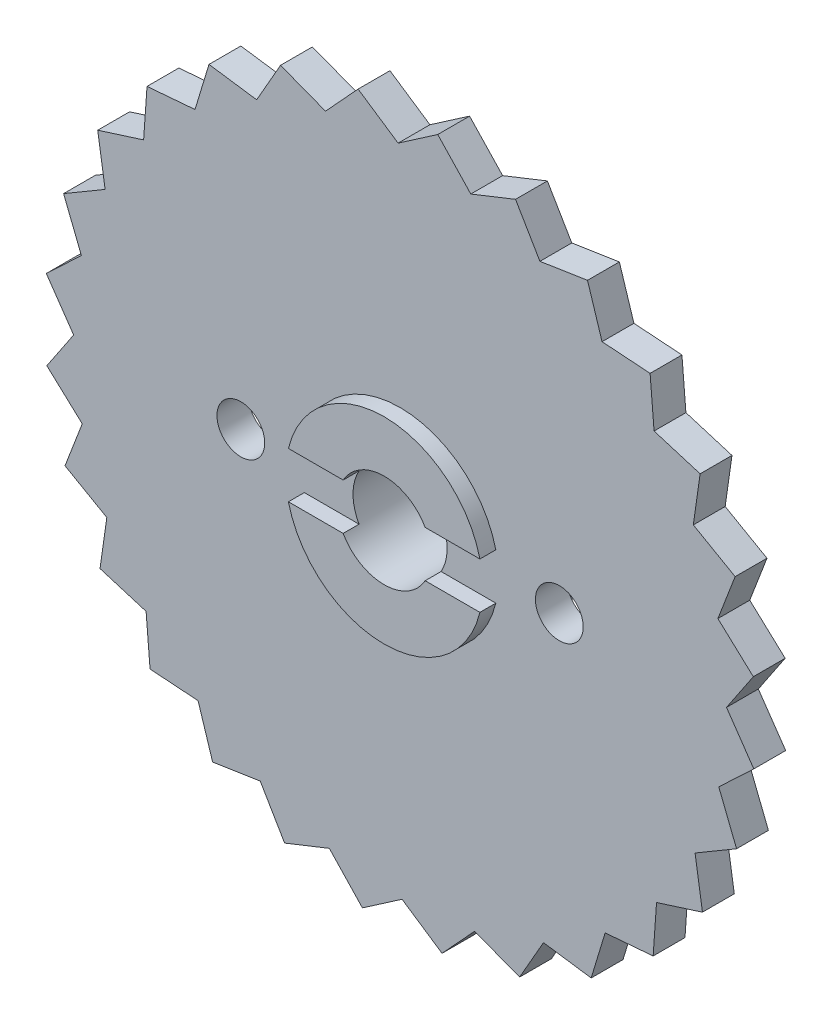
from build123d import *

# Parameters (mm, degrees)
ESQUISSE1_R                   = 22.34
EXTRUSION1_DEPTH              = 9
ENL_V_START                   = -1
ESQUISSE2_R                   = 22.34
ESQUISSE2_R_2                 = 6.185
ENL_V_MAT_EXTRU_1_DEPTH       = 1
ESQUISSE3_R                   = 2.955
ENL_V_MAT_EXTRU_2_DEPTH       = 33.850436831
ESQUISSE4_R                   = 22.34
ESQUISSE4_R_2                 = 8.5
ENL_V_MAT_EXTRU_3_DEPTH       = 6
ESQUISSE5_R                   = 8.5
ESQUISSE5_R_2                 = 6.975
ENL_V_MAT_EXTRU_4_DEPTH       = 1
ESQUISSE6_R                   = 8.5
ESQUISSE6_R_2                 = 5.97
ENL_V_MAT_EXTRU_5_DEPTH       = 3.22
ESQUISSE7_R                   = 8.5
ESQUISSE7_R_2                 = 6.96
ENL_V_MAT_EXTRU_6_DEPTH       = 1.78
ENL_V_MAT_EXTRU_7_DEPTH       = 33.590661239
ENL_V_MAT_EXTRU_14_DEPTH      = 1
ENL_V_MAT_EXTRU_15_DEPTH      = 0.5
ENL_V_MAT_EXTRU_16_DEPTH      = 33.679474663
ENL_V_MAT_EXTRU_16_DEPTH_BACK = 33.679474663
ESQUISSE15_R                  = 1.5
ESQUISSE16_R                  = 1.5
ENL_V_MAT_EXTRU_17_DEPTH      = 10


with BuildPart() as part:
    # Esquisse1 → Extrusion1 (new body)
    with BuildSketch(Plane.XY):
        Circle(ESQUISSE1_R)
    extrude(amount=EXTRUSION1_DEPTH)

    # Esquisse2 → Enl_v. mat.-Extru.1 (cut)
    with BuildSketch(Plane.XY.offset(9).offset(ENL_V_START)):
        Circle(ESQUISSE2_R)
        Circle(ESQUISSE2_R_2, mode=Mode.SUBTRACT)
    extrude(amount=ENL_V_MAT_EXTRU_1_DEPTH, mode=Mode.SUBTRACT)

    # Esquisse3 → Enl_v. mat.-Extru.2 (cut, through all)
    with BuildSketch(Plane.XY.offset(9)):
        Circle(ESQUISSE3_R)
    extrude(amount=-ENL_V_MAT_EXTRU_2_DEPTH, mode=Mode.SUBTRACT)

    # Esquisse4 → Enl_v. mat.-Extru.3 (cut)
    with BuildSketch(Plane(origin=(0, 0, 0), x_dir=(-1, 0, 0), z_dir=(0, 0, -1))):
        Circle(ESQUISSE4_R)
        Circle(ESQUISSE4_R_2, mode=Mode.SUBTRACT)
    extrude(amount=-ENL_V_MAT_EXTRU_3_DEPTH, mode=Mode.SUBTRACT)

    # Esquisse5 → Enl_v. mat.-Extru.4 (cut)
    with BuildSketch(Plane(origin=(0, 0, 0), x_dir=(-1, 0, 0), z_dir=(0, 0, -1))):
        Circle(ESQUISSE5_R)
        Circle(ESQUISSE5_R_2, mode=Mode.SUBTRACT)
    extrude(amount=-ENL_V_MAT_EXTRU_4_DEPTH, mode=Mode.SUBTRACT)

    # Esquisse6 → Enl_v. mat.-Extru.5 (cut)
    with BuildSketch(Plane(origin=(0, 0, 1), x_dir=(-1, 0, 0), z_dir=(0, 0, -1))):
        Circle(ESQUISSE6_R)
        Circle(ESQUISSE6_R_2, mode=Mode.SUBTRACT)
    extrude(amount=-ENL_V_MAT_EXTRU_5_DEPTH, mode=Mode.SUBTRACT)

    # Esquisse7 → Enl_v. mat.-Extru.6 (cut)
    with BuildSketch(Plane(origin=(0, 0, 4.22), x_dir=(-1, 0, 0), z_dir=(0, 0, -1))):
        Circle(ESQUISSE7_R)
        Circle(ESQUISSE7_R_2, mode=Mode.SUBTRACT)
    extrude(amount=-ENL_V_MAT_EXTRU_6_DEPTH, mode=Mode.SUBTRACT)

    # Esquisse9 → Enl_v. mat.-Extru.7 (cut, through all)
    with BuildSketch(Plane.XY.offset(8)):
        with BuildLine():
            Line((-22.183971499, -2.635717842), (-20.49962387, -0.12418215))
            Line((-20.49962387, -0.12418215), (-22.214275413, 2.366763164))
            ThreePointArc((-22.214275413, 2.366763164), (-22.33959011, -0.135328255), (-22.183971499, -2.635717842))
        make_face()
        with BuildLine():
            Line((-19.958022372, -4.682664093), (-22.183971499, -2.635717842))
            ThreePointArc((-22.183971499, -2.635717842), (-21.749376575, -5.102961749), (-21.041270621, -7.50603295))
            Line((-21.041270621, -7.50603295), (-19.958022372, -4.682664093))
        make_face()
        with BuildLine():
            ThreePointArc((-21.130662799, 7.250564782), (-21.809603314, 4.839091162), (-22.214275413, 2.366763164))
            Line((-22.214275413, 2.366763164), (-20.013288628, 4.440526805))
            Line((-20.013288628, 4.440526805), (-21.130662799, 7.250564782))
        make_face()
        with BuildLine():
            Line((-18.415642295, -9.006337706), (-21.041270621, -7.50603295))
            ThreePointArc((-21.041270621, -7.50603295), (-20.068558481, -9.814711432), (-18.843472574, -11.999964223))
            Line((-18.843472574, -11.999964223), (-18.415642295, -9.006337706))
        make_face()
        with BuildLine():
            ThreePointArc((-18.987470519, 11.770792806), (-20.18599194, 9.570858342), (-21.130662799, 7.250564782))
            Line((-21.130662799, 7.250564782), (-18.523403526, 8.782569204))
            Line((-18.523403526, 8.782569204), (-18.987470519, 11.770792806))
        make_face()
        with BuildLine():
            Line((-15.949825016, -12.878395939), (-18.843472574, -11.999964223))
            ThreePointArc((-18.843472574, -11.999964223), (-17.381419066, -14.034310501), (-15.700784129, -15.892167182))
            Line((-15.700784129, -15.892167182), (-15.949825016, -12.878395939))
        make_face()
        with BuildLine():
            ThreePointArc((-15.892167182, 15.700784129), (-17.55017064, 13.822702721), (-18.987470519, 11.770792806))
            Line((-18.987470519, 11.770792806), (-16.104677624, 12.68421691))
            Line((-16.104677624, 12.68421691), (-15.892167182, 15.700784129))
        make_face()
        with BuildLine():
            Line((-12.68421691, -16.104677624), (-15.700784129, -15.892167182))
            ThreePointArc((-15.700784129, -15.892167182), (-13.822702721, -17.55017064), (-11.770792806, -18.987470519))
            Line((-11.770792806, -18.987470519), (-12.68421691, -16.104677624))
        make_face()
        with BuildLine():
            ThreePointArc((-11.999964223, 18.843472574), (-14.034310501, 17.381419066), (-15.892167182, 15.700784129))
            Line((-15.892167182, 15.700784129), (-12.878395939, 15.949825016))
            Line((-12.878395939, 15.949825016), (-11.999964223, 18.843472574))
        make_face()
        with BuildLine():
            Line((-8.782569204, -18.523403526), (-11.770792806, -18.987470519))
            ThreePointArc((-11.770792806, -18.987470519), (-9.570858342, -20.18599194), (-7.250564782, -21.130662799))
            Line((-7.250564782, -21.130662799), (-8.782569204, -18.523403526))
        make_face()
        with BuildLine():
            ThreePointArc((-7.50603295, 21.041270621), (-9.814711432, 20.068558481), (-11.999964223, 18.843472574))
            Line((-11.999964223, 18.843472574), (-9.006337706, 18.415642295))
            Line((-9.006337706, 18.415642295), (-7.50603295, 21.041270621))
        make_face()
        with BuildLine():
            Line((-4.440526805, -20.013288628), (-7.250564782, -21.130662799))
            ThreePointArc((-7.250564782, -21.130662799), (-4.839091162, -21.809603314), (-2.366763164, -22.214275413))
            Line((-2.366763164, -22.214275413), (-4.440526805, -20.013288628))
        make_face()
        with BuildLine():
            ThreePointArc((-2.635717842, 22.183971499), (-5.102961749, 21.749376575), (-7.50603295, 21.041270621))
            Line((-7.50603295, 21.041270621), (-4.682664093, 19.958022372))
            Line((-4.682664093, 19.958022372), (-2.635717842, 22.183971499))
        make_face()
        with BuildLine():
            Line((0.12418215, -20.49962387), (-2.366763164, -22.214275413))
            ThreePointArc((-2.366763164, -22.214275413), (0.135328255, -22.33959011), (2.635717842, -22.183971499))
            Line((2.635717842, -22.183971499), (0.12418215, -20.49962387))
        make_face()
        with BuildLine():
            ThreePointArc((2.366763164, 22.214275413), (-0.135328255, 22.33959011), (-2.635717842, 22.183971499))
            Line((-2.635717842, 22.183971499), (-0.12418215, 20.49962387))
            Line((-0.12418215, 20.49962387), (2.366763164, 22.214275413))
        make_face()
        with BuildLine():
            Line((4.682664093, -19.958022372), (2.635717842, -22.183971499))
            ThreePointArc((2.635717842, -22.183971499), (5.102961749, -21.749376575), (7.50603295, -21.041270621))
            Line((7.50603295, -21.041270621), (4.682664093, -19.958022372))
        make_face()
        with BuildLine():
            ThreePointArc((7.250564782, 21.130662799), (4.839091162, 21.809603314), (2.366763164, 22.214275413))
            Line((2.366763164, 22.214275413), (4.440526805, 20.013288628))
            Line((4.440526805, 20.013288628), (7.250564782, 21.130662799))
        make_face()
        with BuildLine():
            Line((9.006337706, -18.415642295), (7.50603295, -21.041270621))
            ThreePointArc((7.50603295, -21.041270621), (9.814711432, -20.068558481), (11.999964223, -18.843472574))
            Line((11.999964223, -18.843472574), (9.006337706, -18.415642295))
        make_face()
        with BuildLine():
            ThreePointArc((11.770792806, 18.987470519), (9.570858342, 20.18599194), (7.250564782, 21.130662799))
            Line((7.250564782, 21.130662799), (8.782569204, 18.523403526))
            Line((8.782569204, 18.523403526), (11.770792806, 18.987470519))
        make_face()
        with BuildLine():
            Line((12.878395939, -15.949825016), (11.999964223, -18.843472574))
            ThreePointArc((11.999964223, -18.843472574), (14.034310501, -17.381419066), (15.892167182, -15.700784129))
            Line((15.892167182, -15.700784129), (12.878395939, -15.949825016))
        make_face()
        with BuildLine():
            ThreePointArc((15.700784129, 15.892167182), (13.822702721, 17.55017064), (11.770792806, 18.987470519))
            Line((11.770792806, 18.987470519), (12.68421691, 16.104677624))
            Line((12.68421691, 16.104677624), (15.700784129, 15.892167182))
        make_face()
        with BuildLine():
            Line((16.104677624, -12.68421691), (15.892167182, -15.700784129))
            ThreePointArc((15.892167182, -15.700784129), (17.55017064, -13.822702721), (18.987470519, -11.770792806))
            Line((18.987470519, -11.770792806), (16.104677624, -12.68421691))
        make_face()
        with BuildLine():
            ThreePointArc((18.843472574, 11.999964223), (17.381419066, 14.034310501), (15.700784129, 15.892167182))
            Line((15.700784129, 15.892167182), (15.949825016, 12.878395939))
            Line((15.949825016, 12.878395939), (18.843472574, 11.999964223))
        make_face()
        with BuildLine():
            Line((18.523403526, -8.782569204), (18.987470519, -11.770792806))
            ThreePointArc((18.987470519, -11.770792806), (20.18599194, -9.570858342), (21.130662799, -7.250564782))
            Line((21.130662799, -7.250564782), (18.523403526, -8.782569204))
        make_face()
        with BuildLine():
            ThreePointArc((21.041270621, 7.50603295), (20.068558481, 9.814711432), (18.843472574, 11.999964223))
            Line((18.843472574, 11.999964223), (18.415642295, 9.006337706))
            Line((18.415642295, 9.006337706), (21.041270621, 7.50603295))
        make_face()
        with BuildLine():
            Line((20.013288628, -4.440526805), (21.130662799, -7.250564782))
            ThreePointArc((21.130662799, -7.250564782), (21.809603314, -4.839091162), (22.214275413, -2.366763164))
            Line((22.214275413, -2.366763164), (20.013288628, -4.440526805))
        make_face()
        with BuildLine():
            ThreePointArc((22.183971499, 2.635717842), (21.749376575, 5.102961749), (21.041270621, 7.50603295))
            Line((21.041270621, 7.50603295), (19.958022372, 4.682664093))
            Line((19.958022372, 4.682664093), (22.183971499, 2.635717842))
        make_face()
        with BuildLine():
            Line((20.49962387, 0.12418215), (22.214275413, -2.366763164))
            ThreePointArc((22.214275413, -2.366763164), (22.33959011, 0.135328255), (22.183971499, 2.635717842))
            Line((22.183971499, 2.635717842), (20.49962387, 0.12418215))
        make_face()
    extrude(amount=-ENL_V_MAT_EXTRU_7_DEPTH, mode=Mode.SUBTRACT)

    # Esquisse13 → Enl_v. mat.-Extru.14 (cut)
    with BuildSketch(Plane.XY.offset(9)):
        Polygon((6.185, 0), (6.185, 1.45), (-6.185, 1.45), (-6.185, 0), (-6.185, -1.45), (6.185, -1.45), align=None)
    extrude(amount=-ENL_V_MAT_EXTRU_14_DEPTH, mode=Mode.SUBTRACT)

    # Esquisse14 → Enl_v. mat.-Extru.15 (cut)
    with BuildSketch(Plane(origin=(0, 0, 0), x_dir=(-1, 0, 0), z_dir=(0, 0, -1))):
        Polygon((6.975, 0), (6.975, 1.45), (-6.975, 1.45), (-6.975, -1.45), (6.975, -1.45), align=None)
    extrude(amount=-ENL_V_MAT_EXTRU_15_DEPTH, mode=Mode.SUBTRACT)

    # Esquisse15 → Enl_v. mat.-Extru.16 (cut, two sides: drawn at the far end of the back side and taken through both)
    with BuildSketch(Plane(origin=(0, 0, 0), x_dir=(0, 0, -1), z_dir=(1, 0, 0)).offset(-ENL_V_MAT_EXTRU_16_DEPTH_BACK)):
        with Locations((-2.61, 0)):
            Circle(ESQUISSE15_R)
    extrude(amount=ENL_V_MAT_EXTRU_16_DEPTH + ENL_V_MAT_EXTRU_16_DEPTH_BACK, mode=Mode.SUBTRACT)

    # Esquisse16 → Enl_v. mat.-Extru.17 (cut)
    with BuildSketch(Plane.XY.offset(8)):
        with Locations((-10, 0)):
            Circle(ESQUISSE16_R)
        with Locations(Location((10, 0, 0), (0, 0, 180))):
            Circle(ESQUISSE16_R)
    extrude(amount=-ENL_V_MAT_EXTRU_17_DEPTH, mode=Mode.SUBTRACT)


solid = part.part
